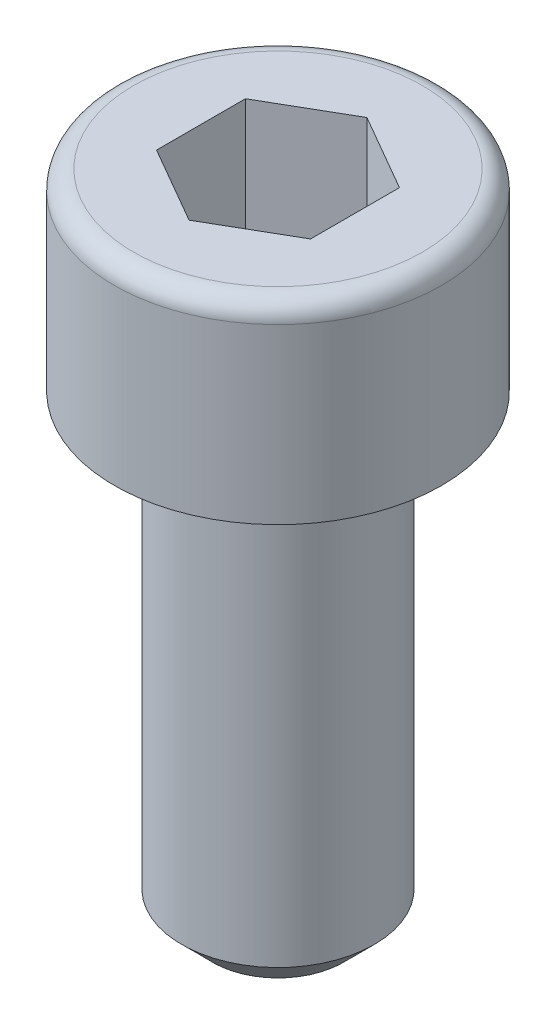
from build123d import *

# Parameters (mm, degrees)
EMPREINTE_DEPTH = 3.6


with BuildPart() as part:
    # E_corps → corps (revolve)
    with BuildSketch(Plane.XY, mode=Mode.PRIVATE) as corps_sk:
        with BuildLine():
            Line((2.5, -5), (4.25, -5))
            Line((4.25, -5), (4.25, -0.5))
            ThreePointArc((4.25, -0.5), (4.103553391, -0.146446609), (3.75, 0))
            Line((3.75, 0), (0, 0))
            Line((0, 0), (0, -17))
            Line((0, -17), (1.7, -17))
            Line((1.7, -17), (2.5, -16.2))
            Line((2.5, -16.2), (2.5, -5))
        make_face()
    revolve(corps_sk.sketch.rotate(Axis((0, 65.117292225, 0), (0, -1, 0)), 180), axis=Axis((0, 65.117292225, 0), (0, -1, 0)))

    # E_empreinte → Empreinte (cut)
    with BuildSketch(Plane(origin=(0, 0, 0), x_dir=(-1, 0, 0), z_dir=(0, 1, 0))):
        Polygon((0, -2.309401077), (-2, -1.154700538), (-2, 1.154700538), (0, 2.309401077), (2, 1.154700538), (2, -1.154700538), align=None)
    extrude(amount=-EMPREINTE_DEPTH, mode=Mode.SUBTRACT)

    # Esquisse2 → Enlever de la mati_re-lisser1 section 0
    with BuildSketch(Plane(origin=(0, -3.6, 0), x_dir=(-1, 0, 0), z_dir=(0, 1, 0)), mode=Mode.PRIVATE) as enlever_de_la_mati_re_lisser1_s0:
        with BuildLine():
            Line((0, -2.309401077), (2, -1.154700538))
            Line((2, -1.154700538), (2, 1.154700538))
            Line((2, 1.154700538), (0, 2.309401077))
            Line((0, 2.309401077), (-2, 1.154700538))
            Line((-2, 1.154700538), (-2, -1.154700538))
            Line((-2, -1.154700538), (0, -2.309401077))
        make_face()
    loft([Vertex(0, -4, 0), enlever_de_la_mati_re_lisser1_s0.sketch], mode=Mode.SUBTRACT)


solid = part.part
